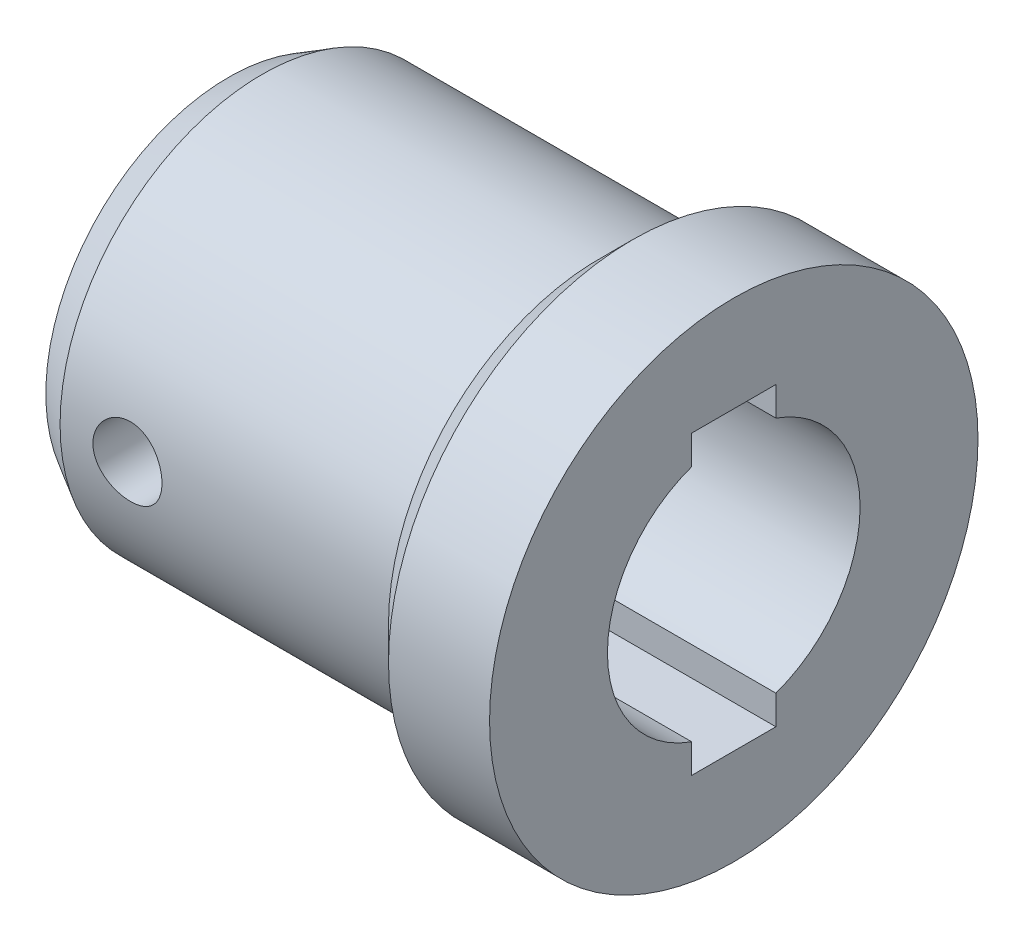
ISO-10303-21;
HEADER;
FILE_DESCRIPTION(('STEP AP214'),'2;1');
FILE_NAME('part.step','',(''),(''),'','','');
FILE_SCHEMA(('AUTOMOTIVE_DESIGN { 1 0 10303 214 1 1 1 1 }'));
ENDSEC;
DATA;
#1=APPLICATION_CONTEXT('core data for automotive mechanical design processes');
#2=APPLICATION_PROTOCOL_DEFINITION('international standard','automotive_design',2000,#1);
#3=PRODUCT_CONTEXT('',#1,'mechanical');
#4=PRODUCT('Part','Part','',(#3));
#5=PRODUCT_RELATED_PRODUCT_CATEGORY('part','',(#4));
#6=PRODUCT_DEFINITION_FORMATION('','',#4);
#7=PRODUCT_DEFINITION_CONTEXT('part definition',#1,'design');
#8=PRODUCT_DEFINITION('design','',#6,#7);
#9=PRODUCT_DEFINITION_SHAPE('','',#8);
#10=(LENGTH_UNIT() NAMED_UNIT(*) SI_UNIT(.MILLI.,.METRE.));
#11=(NAMED_UNIT(*) PLANE_ANGLE_UNIT() SI_UNIT($,.RADIAN.));
#12=(NAMED_UNIT(*) SI_UNIT($,.STERADIAN.) SOLID_ANGLE_UNIT());
#13=UNCERTAINTY_MEASURE_WITH_UNIT(LENGTH_MEASURE(1.E-05),#10,'distance_accuracy_value','');
#14=(GEOMETRIC_REPRESENTATION_CONTEXT(3) GLOBAL_UNCERTAINTY_ASSIGNED_CONTEXT((#13)) GLOBAL_UNIT_ASSIGNED_CONTEXT((#10,
#11,#12)) REPRESENTATION_CONTEXT('',''));
#15=CARTESIAN_POINT('',(0.,0.,0.));
#16=DIRECTION('',(0.,0.,1.));
#17=DIRECTION('',(1.,0.,0.));
#18=AXIS2_PLACEMENT_3D('',#15,#16,#17);
#19=CARTESIAN_POINT('',(0.,0.,0.));
#20=DIRECTION('',(-1.,0.,0.));
#21=DIRECTION('',(0.,0.,1.));
#22=AXIS2_PLACEMENT_3D('',#19,#20,#21);
#23=CYLINDRICAL_SURFACE('',#22,7.5);
#24=CARTESIAN_POINT('',(30.,0.,0.));
#25=DIRECTION('',(1.,0.,0.));
#26=DIRECTION('',(0.,0.,-1.));
#27=AXIS2_PLACEMENT_3D('',#24,#25,#26);
#28=CIRCLE('',#27,7.5);
#29=CARTESIAN_POINT('',(30.,-7.07106781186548,2.5));
#30=VERTEX_POINT('',#29);
#31=CARTESIAN_POINT('',(30.,7.07106781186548,2.5));
#32=VERTEX_POINT('',#31);
#33=EDGE_CURVE('E129',#30,#32,#28,.F.);
#34=ORIENTED_EDGE('',*,*,#33,.F.);
#35=DIRECTION('',(1.,0.,0.));
#36=VECTOR('',#35,1.);
#37=CARTESIAN_POINT('',(0.,-7.07106781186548,2.5));
#38=LINE('',#37,#36);
#39=CARTESIAN_POINT('',(0.,-7.07106781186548,2.5));
#40=VERTEX_POINT('',#39);
#41=EDGE_CURVE('E112',#40,#30,#38,.T.);
#42=ORIENTED_EDGE('',*,*,#41,.F.);
#43=CARTESIAN_POINT('',(0.,0.,0.));
#44=DIRECTION('',(-1.,0.,0.));
#45=DIRECTION('',(0.,0.,1.));
#46=AXIS2_PLACEMENT_3D('',#43,#44,#45);
#47=CIRCLE('',#46,7.5);
#48=CARTESIAN_POINT('',(0.,7.07106781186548,2.5));
#49=VERTEX_POINT('',#48);
#50=EDGE_CURVE('E160',#40,#49,#47,.T.);
#51=ORIENTED_EDGE('',*,*,#50,.T.);
#52=DIRECTION('',(1.,0.,0.));
#53=VECTOR('',#52,1.);
#54=CARTESIAN_POINT('',(0.,7.07106781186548,2.5));
#55=LINE('',#54,#53);
#56=EDGE_CURVE('E139',#49,#32,#55,.T.);
#57=ORIENTED_EDGE('',*,*,#56,.T.);
#58=EDGE_LOOP('',(#34,#42,#51,#57));
#59=FACE_BOUND('',#58,.T.);
#60=CARTESIAN_POINT('',(8.05,0.,7.5));
#61=CARTESIAN_POINT('',(8.04999754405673,-0.112905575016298,7.49999840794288));
#62=CARTESIAN_POINT('',(8.04064122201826,-0.225837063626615,7.497425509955));
#63=CARTESIAN_POINT('',(8.00353366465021,-0.448439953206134,7.48741184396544));
#64=CARTESIAN_POINT('',(7.97577422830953,-0.558109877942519,7.47996890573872));
#65=CARTESIAN_POINT('',(7.90283553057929,-0.770944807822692,7.46103553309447));
#66=CARTESIAN_POINT('',(7.85767936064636,-0.874118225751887,7.44955046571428));
#67=CARTESIAN_POINT('',(7.75131638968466,-1.07142788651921,7.42374272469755));
#68=CARTESIAN_POINT('',(7.69010830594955,-1.16556340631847,7.40941982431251));
#69=CARTESIAN_POINT('',(7.55181201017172,-1.34440842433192,7.37909077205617));
#70=CARTESIAN_POINT('',(7.47440650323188,-1.42886749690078,7.36305471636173));
#71=CARTESIAN_POINT('',(7.30659048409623,-1.58378179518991,7.33129604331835));
#72=CARTESIAN_POINT('',(7.21617820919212,-1.65423511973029,7.31557346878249));
#73=CARTESIAN_POINT('',(7.02289338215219,-1.78037731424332,7.28591410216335));
#74=CARTESIAN_POINT('',(6.91982432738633,-1.83577475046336,7.27201493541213));
#75=CARTESIAN_POINT('',(6.70539349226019,-1.92835423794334,7.24801719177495));
#76=CARTESIAN_POINT('',(6.59403333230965,-1.96553983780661,7.23791787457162));
#77=CARTESIAN_POINT('',(6.36896263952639,-2.01976397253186,7.22297261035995));
#78=CARTESIAN_POINT('',(6.25536992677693,-2.03725806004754,7.21800810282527));
#79=CARTESIAN_POINT('',(6.02676179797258,-2.05302331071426,7.21354061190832));
#80=CARTESIAN_POINT('',(5.91174666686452,-2.05129826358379,7.21403655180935));
#81=CARTESIAN_POINT('',(5.68714187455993,-2.02903513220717,7.22032800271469));
#82=CARTESIAN_POINT('',(5.57749213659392,-2.00905189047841,7.22596720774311));
#83=CARTESIAN_POINT('',(5.36316432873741,-1.95172975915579,7.24165902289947));
#84=CARTESIAN_POINT('',(5.25848667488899,-1.91438942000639,7.25171200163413));
#85=CARTESIAN_POINT('',(5.05564536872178,-1.82296940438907,7.27523361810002));
#86=CARTESIAN_POINT('',(4.95757279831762,-1.76869803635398,7.2887410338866));
#87=CARTESIAN_POINT('',(4.77173341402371,-1.64509014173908,7.31762916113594));
#88=CARTESIAN_POINT('',(4.68396872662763,-1.57575051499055,7.33301025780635));
#89=CARTESIAN_POINT('',(4.51807058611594,-1.4211529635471,7.36456014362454));
#90=CARTESIAN_POINT('',(4.44037144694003,-1.33543011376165,7.38073784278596));
#91=CARTESIAN_POINT('',(4.30036033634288,-1.15197228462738,7.41158548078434));
#92=CARTESIAN_POINT('',(4.23804903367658,-1.05423678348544,7.42625535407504));
#93=CARTESIAN_POINT('',(4.13037764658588,-0.848833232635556,7.45253238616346));
#94=CARTESIAN_POINT('',(4.08509953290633,-0.741120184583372,7.46412465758));
#95=CARTESIAN_POINT('',(4.0134212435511,-0.519220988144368,7.48283289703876));
#96=CARTESIAN_POINT('',(3.98701672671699,-0.405036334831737,7.4899498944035));
#97=CARTESIAN_POINT('',(3.95452490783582,-0.177138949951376,7.4987486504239));
#98=CARTESIAN_POINT('',(3.94784749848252,-0.0635163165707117,7.5005882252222));
#99=CARTESIAN_POINT('',(3.95336513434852,0.163226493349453,7.4990803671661));
#100=CARTESIAN_POINT('',(3.96555812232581,0.276346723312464,7.49573349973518));
#101=CARTESIAN_POINT('',(4.00798756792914,0.496744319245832,7.48433104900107));
#102=CARTESIAN_POINT('',(4.03789188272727,0.604090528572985,7.47636219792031));
#103=CARTESIAN_POINT('',(4.11450675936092,0.812229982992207,7.45662264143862));
#104=CARTESIAN_POINT('',(4.16121918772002,0.913022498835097,7.44485151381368));
#105=CARTESIAN_POINT('',(4.27119867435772,1.10746327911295,7.41844695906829));
#106=CARTESIAN_POINT('',(4.33478279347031,1.20092478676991,7.40376023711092));
#107=CARTESIAN_POINT('',(4.47630480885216,1.37605750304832,7.37322058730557));
#108=CARTESIAN_POINT('',(4.55424568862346,1.45772625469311,7.35736741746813));
#109=CARTESIAN_POINT('',(4.72502734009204,1.60946395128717,7.32569595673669));
#110=CARTESIAN_POINT('',(4.8182422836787,1.67911570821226,7.30989272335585));
#111=CARTESIAN_POINT('',(5.0153741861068,1.80180118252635,7.28062534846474));
#112=CARTESIAN_POINT('',(5.11929071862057,1.85483556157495,7.2671611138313));
#113=CARTESIAN_POINT('',(5.33438277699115,1.94238379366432,7.24425250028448));
#114=CARTESIAN_POINT('',(5.44551308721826,1.97700247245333,7.23478543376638));
#115=CARTESIAN_POINT('',(5.67232271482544,2.02696884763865,7.2209474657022));
#116=CARTESIAN_POINT('',(5.78800078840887,2.04232177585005,7.21657518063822));
#117=CARTESIAN_POINT('',(6.01633968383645,2.05300887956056,7.21354148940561));
#118=CARTESIAN_POINT('',(6.12896695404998,2.04901527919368,7.21468830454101));
#119=CARTESIAN_POINT('',(6.35187658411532,2.02269068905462,7.22211226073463));
#120=CARTESIAN_POINT('',(6.46215901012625,2.00036021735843,7.2283892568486));
#121=CARTESIAN_POINT('',(6.67635425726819,1.93839445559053,7.24524925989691));
#122=CARTESIAN_POINT('',(6.78031338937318,1.89890841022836,7.25579507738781));
#123=CARTESIAN_POINT('',(6.98021136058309,1.80386792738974,7.28000374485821));
#124=CARTESIAN_POINT('',(7.07614888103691,1.74831085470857,7.2936671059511));
#125=CARTESIAN_POINT('',(7.26047220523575,1.62069692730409,7.32309689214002));
#126=CARTESIAN_POINT('',(7.34853444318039,1.54818461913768,7.33891512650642));
#127=CARTESIAN_POINT('',(7.51145916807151,1.38957584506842,7.37059076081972));
#128=CARTESIAN_POINT('',(7.5863184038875,1.30347604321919,7.38644816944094));
#129=CARTESIAN_POINT('',(7.72239630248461,1.11776612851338,7.41684843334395));
#130=CARTESIAN_POINT('',(7.78326470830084,1.01789254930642,7.43135303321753));
#131=CARTESIAN_POINT('',(7.88725280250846,0.808935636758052,7.45698800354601));
#132=CARTESIAN_POINT('',(7.93038330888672,0.699857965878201,7.46812042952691));
#133=CARTESIAN_POINT('',(7.99237561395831,0.492734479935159,7.48440479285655));
#134=CARTESIAN_POINT('',(8.01393304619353,0.39553846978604,7.49020932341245));
#135=CARTESIAN_POINT('',(8.04274553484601,0.198901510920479,7.49800741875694));
#136=CARTESIAN_POINT('',(8.05000216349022,0.0994608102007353,7.50000140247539));
#137=CARTESIAN_POINT('',(8.05,0.,7.5));
#138=B_SPLINE_CURVE_WITH_KNOTS('',3,(#60,#61,#62,#63,#64,#65,#66,#67,#68,#69,#70,#71,#72,#73,
#74,#75,#76,#77,#78,#79,#80,#81,#82,#83,#84,#85,#86,#87,#88,#89,#90,#91,#92,#93,#94,#95,#96,#97,
#98,#99,#100,#101,#102,#103,#104,#105,#106,#107,#108,#109,#110,#111,#112,#113,#114,#115,#116,
#117,#118,#119,#120,#121,#122,#123,#124,#125,#126,#127,#128,#129,#130,#131,#132,#133,#134,#135,
#136,#137),.UNSPECIFIED.,.T.,.F.,(4,2,2,2,2,2,2,2,2,2,2,2,2,2,2,2,2,2,2,2,2,2,2,2,2,2,2,2,2,2,2,
2,2,2,2,2,2,2,4),(0.,0.338351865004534,0.676854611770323,1.01490958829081,1.352991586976,
1.69844880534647,2.04395288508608,2.39573284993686,2.74744424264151,3.09084008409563,
3.43416821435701,3.76739799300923,4.10065560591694,4.43783235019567,4.77507853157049,
5.12390751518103,5.47275165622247,5.82325373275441,6.17367516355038,6.51350246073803,
6.85329271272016,7.18690405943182,7.52055246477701,7.86097965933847,8.20147767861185,
8.55210162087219,8.90271160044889,9.25130388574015,9.59980148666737,9.93627865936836,
10.2727463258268,10.606343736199,10.9399958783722,11.2839235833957,11.6279358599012,
11.9797984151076,12.3314460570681,12.629539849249,12.9276008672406),.UNSPECIFIED.);
#139=CARTESIAN_POINT('',(8.05,0.,7.5));
#140=VERTEX_POINT('',#139);
#141=EDGE_CURVE('E134',#140,#140,#138,.T.);
#142=ORIENTED_EDGE('',*,*,#141,.F.);
#143=EDGE_LOOP('',(#142));
#144=FACE_BOUND('',#143,.T.);
#145=ADVANCED_FACE('F40',(#59,#144),#23,.F.);
#146=CARTESIAN_POINT('',(0.,0.,0.));
#147=DIRECTION('',(-1.,0.,0.));
#148=DIRECTION('',(0.,0.,1.));
#149=AXIS2_PLACEMENT_3D('',#146,#147,#148);
#150=CYLINDRICAL_SURFACE('',#149,12.);
#151=CARTESIAN_POINT('',(22.,0.,0.));
#152=DIRECTION('',(-1.,0.,0.));
#153=DIRECTION('',(0.,0.,1.));
#154=AXIS2_PLACEMENT_3D('',#151,#152,#153);
#155=CIRCLE('',#154,12.);
#156=CARTESIAN_POINT('',(22.,0.,12.));
#157=VERTEX_POINT('',#156);
#158=EDGE_CURVE('E142',#157,#157,#155,.T.);
#159=ORIENTED_EDGE('',*,*,#158,.T.);
#160=EDGE_LOOP('',(#159));
#161=FACE_BOUND('',#160,.T.);
#162=CARTESIAN_POINT('',(2.00000000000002,0.,0.));
#163=DIRECTION('',(1.,0.,0.));
#164=DIRECTION('',(0.,0.,-1.));
#165=AXIS2_PLACEMENT_3D('',#162,#163,#164);
#166=CIRCLE('',#165,12.);
#167=CARTESIAN_POINT('',(2.00000000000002,0.,-12.));
#168=VERTEX_POINT('',#167);
#169=EDGE_CURVE('E148',#168,#168,#166,.T.);
#170=ORIENTED_EDGE('',*,*,#169,.T.);
#171=EDGE_LOOP('',(#170));
#172=FACE_BOUND('',#171,.T.);
#173=CARTESIAN_POINT('',(8.05,0.,12.));
#174=CARTESIAN_POINT('',(8.04999545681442,0.114258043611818,11.9999980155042));
#175=CARTESIAN_POINT('',(8.04041536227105,0.228577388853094,11.9983511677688));
#176=CARTESIAN_POINT('',(8.00236570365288,0.454006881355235,11.9919401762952));
#177=CARTESIAN_POINT('',(7.97387904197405,0.565114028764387,11.9871732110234));
#178=CARTESIAN_POINT('',(7.89890386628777,0.780825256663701,11.9750563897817));
#179=CARTESIAN_POINT('',(7.85243037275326,0.88543467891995,11.9677086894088));
#180=CARTESIAN_POINT('',(7.74284072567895,1.08535849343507,11.9512372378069));
#181=CARTESIAN_POINT('',(7.6797263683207,1.18067388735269,11.9421136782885));
#182=CARTESIAN_POINT('',(7.53797392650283,1.36027196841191,11.9229988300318));
#183=CARTESIAN_POINT('',(7.4592016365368,1.44444799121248,11.9130004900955));
#184=CARTESIAN_POINT('',(7.28865822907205,1.59845623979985,11.8933166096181));
#185=CARTESIAN_POINT('',(7.1968862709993,1.66828753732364,11.8836310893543));
#186=CARTESIAN_POINT('',(7.00221181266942,1.7920546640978,11.8656011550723));
#187=CARTESIAN_POINT('',(6.89924096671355,1.84588443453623,11.8572658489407));
#188=CARTESIAN_POINT('',(6.68555224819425,1.93544211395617,11.8429782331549));
#189=CARTESIAN_POINT('',(6.57483492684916,1.97117130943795,11.8370257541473));
#190=CARTESIAN_POINT('',(6.34992889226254,2.02317633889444,11.8282481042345));
#191=CARTESIAN_POINT('',(6.23578402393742,2.03963669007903,11.8253932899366));
#192=CARTESIAN_POINT('',(6.00631956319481,2.053209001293,11.8230445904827));
#193=CARTESIAN_POINT('',(5.89100005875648,2.05032239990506,11.8235504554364));
#194=CARTESIAN_POINT('',(5.66378072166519,2.02543291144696,11.8278389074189));
#195=CARTESIAN_POINT('',(5.5518573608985,2.00363778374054,11.8315858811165));
#196=CARTESIAN_POINT('',(5.33327965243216,1.94187619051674,11.8418785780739));
#197=CARTESIAN_POINT('',(5.22662549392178,1.90190907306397,11.8484244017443));
#198=CARTESIAN_POINT('',(5.0209944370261,1.80472881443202,11.8636154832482));
#199=CARTESIAN_POINT('',(4.92205889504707,1.74742985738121,11.8722711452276));
#200=CARTESIAN_POINT('',(4.73512813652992,1.61727330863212,11.8906994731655));
#201=CARTESIAN_POINT('',(4.64713384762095,1.54441439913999,11.9004722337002));
#202=CARTESIAN_POINT('',(4.4833812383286,1.38407642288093,11.9201898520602));
#203=CARTESIAN_POINT('',(4.40779731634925,1.29641920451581,11.9301352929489));
#204=CARTESIAN_POINT('',(4.27238403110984,1.10957416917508,11.9489600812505));
#205=CARTESIAN_POINT('',(4.21255477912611,1.01038627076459,11.9578394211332));
#206=CARTESIAN_POINT('',(4.1103314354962,0.803128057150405,11.9735451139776));
#207=CARTESIAN_POINT('',(4.06795327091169,0.695049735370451,11.9803695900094));
#208=CARTESIAN_POINT('',(4.00199966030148,0.473166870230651,11.9911816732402));
#209=CARTESIAN_POINT('',(3.97842256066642,0.359362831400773,11.995169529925));
#210=CARTESIAN_POINT('',(3.9509779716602,0.130761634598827,11.9998253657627));
#211=CARTESIAN_POINT('',(3.94687115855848,0.0159940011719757,12.0005336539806));
#212=CARTESIAN_POINT('',(3.95784492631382,-0.212589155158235,11.9986611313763));
#213=CARTESIAN_POINT('',(3.97292473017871,-0.326404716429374,11.996080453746));
#214=CARTESIAN_POINT('',(4.02164462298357,-0.549109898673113,11.9879449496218));
#215=CARTESIAN_POINT('',(4.05516572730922,-0.658026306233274,11.9824091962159));
#216=CARTESIAN_POINT('',(4.13968947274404,-0.868693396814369,11.9689817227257));
#217=CARTESIAN_POINT('',(4.19069313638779,-0.970443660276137,11.961089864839));
#218=CARTESIAN_POINT('',(4.30927878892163,-1.16492623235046,11.9437254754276));
#219=CARTESIAN_POINT('',(4.3770096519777,-1.25756649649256,11.934239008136));
#220=CARTESIAN_POINT('',(4.52692292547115,-1.4302516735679,11.9147784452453));
#221=CARTESIAN_POINT('',(4.60910644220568,-1.51029562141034,11.9048043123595));
#222=CARTESIAN_POINT('',(4.78666749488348,-1.65640741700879,11.8853615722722));
#223=CARTESIAN_POINT('',(4.88217920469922,-1.72231324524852,11.875899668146));
#224=CARTESIAN_POINT('',(5.08305863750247,-1.83714499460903,11.8586796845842));
#225=CARTESIAN_POINT('',(5.18842603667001,-1.88607147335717,11.8509215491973));
#226=CARTESIAN_POINT('',(5.4055808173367,-1.96531574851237,11.8380382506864));
#227=CARTESIAN_POINT('',(5.51733852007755,-1.99571296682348,11.8329018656));
#228=CARTESIAN_POINT('',(5.74446900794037,-2.03728491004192,11.825815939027));
#229=CARTESIAN_POINT('',(5.85984146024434,-2.04846139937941,11.8238661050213));
#230=CARTESIAN_POINT('',(6.0893076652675,-2.05122352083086,11.823387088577));
#231=CARTESIAN_POINT('',(6.20339833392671,-2.04306427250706,11.8248133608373));
#232=CARTESIAN_POINT('',(6.42855771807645,-2.00793949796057,11.8308280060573));
#233=CARTESIAN_POINT('',(6.53962644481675,-1.98097404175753,11.8354163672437));
#234=CARTESIAN_POINT('',(6.75548306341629,-1.90910197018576,11.8472209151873));
#235=CARTESIAN_POINT('',(6.86027882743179,-1.86421840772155,11.8544337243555));
#236=CARTESIAN_POINT('',(7.06089402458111,-1.75781070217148,11.8706775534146));
#237=CARTESIAN_POINT('',(7.15671297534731,-1.69628566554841,11.8797086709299));
#238=CARTESIAN_POINT('',(7.33794148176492,-1.55743545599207,11.8987122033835));
#239=CARTESIAN_POINT('',(7.42320646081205,-1.47992296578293,11.908694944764));
#240=CARTESIAN_POINT('',(7.57960614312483,-1.3116924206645,11.9283955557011));
#241=CARTESIAN_POINT('',(7.65073758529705,-1.22097132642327,11.9381133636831));
#242=CARTESIAN_POINT('',(7.77732743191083,-1.02811092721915,11.9562715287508));
#243=CARTESIAN_POINT('',(7.83266774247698,-0.925893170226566,11.9647020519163));
#244=CARTESIAN_POINT('',(7.92530566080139,-0.713507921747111,11.9792400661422));
#245=CARTESIAN_POINT('',(7.9626210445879,-0.603348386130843,11.9853498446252));
#246=CARTESIAN_POINT('',(8.01014947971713,-0.410649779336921,11.9932412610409));
#247=CARTESIAN_POINT('',(8.02506919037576,-0.329269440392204,11.9957620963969));
#248=CARTESIAN_POINT('',(8.04499600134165,-0.16527007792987,11.9991421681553));
#249=CARTESIAN_POINT('',(8.05000328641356,-0.0826510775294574,12.0000014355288));
#250=CARTESIAN_POINT('',(8.05,0.,12.));
#251=B_SPLINE_CURVE_WITH_KNOTS('',3,(#173,#174,#175,#176,#177,#178,#179,#180,#181,#182,#183,
#184,#185,#186,#187,#188,#189,#190,#191,#192,#193,#194,#195,#196,#197,#198,#199,#200,#201,#202,
#203,#204,#205,#206,#207,#208,#209,#210,#211,#212,#213,#214,#215,#216,#217,#218,#219,#220,#221,
#222,#223,#224,#225,#226,#227,#228,#229,#230,#231,#232,#233,#234,#235,#236,#237,#238,#239,#240,
#241,#242,#243,#244,#245,#246,#247,#248,#249,#250),.UNSPECIFIED.,.T.,.F.,(4,2,2,2,2,2,2,2,2,2,2,
2,2,2,2,2,2,2,2,2,2,2,2,2,2,2,2,2,2,2,2,2,2,2,2,2,2,2,4),(0.,0.342471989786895,
0.685254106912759,1.02775058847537,1.37021011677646,1.71574236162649,2.06129695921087,
2.40909329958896,2.75686491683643,3.1012783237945,3.44566612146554,3.78631717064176,
4.12698044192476,4.46935885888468,4.81176628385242,5.15863584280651,5.50550785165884,
5.85269574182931,6.19985309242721,6.54273201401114,6.88559705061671,7.22627540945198,
7.56697369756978,7.91082101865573,8.25469467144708,8.60232026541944,8.9499344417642,
9.29604796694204,9.64212971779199,9.98367067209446,10.3252103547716,10.6663120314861,
11.007432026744,11.352802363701,11.69825229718,12.046221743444,12.3938473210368,
12.6415866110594,12.889321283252),.UNSPECIFIED.);
#252=CARTESIAN_POINT('',(8.05,0.,12.));
#253=VERTEX_POINT('',#252);
#254=EDGE_CURVE('E44',#253,#253,#251,.T.);
#255=ORIENTED_EDGE('',*,*,#254,.F.);
#256=EDGE_LOOP('',(#255));
#257=FACE_BOUND('',#256,.T.);
#258=ADVANCED_FACE('F240',(#161,#172,#257),#150,.T.);
#259=CARTESIAN_POINT('',(0.,7.07106781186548,-2.5));
#260=VERTEX_POINT('',#259);
#261=CARTESIAN_POINT('',(0.,-7.07106781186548,-2.5));
#262=VERTEX_POINT('',#261);
#263=EDGE_CURVE('E157',#260,#262,#47,.T.);
#264=ORIENTED_EDGE('',*,*,#263,.T.);
#265=DIRECTION('',(1.,0.,0.));
#266=VECTOR('',#265,1.);
#267=CARTESIAN_POINT('',(0.,-7.07106781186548,-2.5));
#268=LINE('',#267,#266);
#269=CARTESIAN_POINT('',(30.,-7.07106781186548,-2.5));
#270=VERTEX_POINT('',#269);
#271=EDGE_CURVE('E181',#262,#270,#268,.T.);
#272=ORIENTED_EDGE('',*,*,#271,.T.);
#273=CARTESIAN_POINT('',(30.,7.07106781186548,-2.5));
#274=VERTEX_POINT('',#273);
#275=EDGE_CURVE('E140',#274,#270,#28,.F.);
#276=ORIENTED_EDGE('',*,*,#275,.F.);
#277=DIRECTION('',(1.,0.,0.));
#278=VECTOR('',#277,1.);
#279=CARTESIAN_POINT('',(0.,7.07106781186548,-2.5));
#280=LINE('',#279,#278);
#281=EDGE_CURVE('E164',#260,#274,#280,.T.);
#282=ORIENTED_EDGE('',*,*,#281,.F.);
#283=EDGE_LOOP('',(#264,#272,#276,#282));
#284=FACE_BOUND('',#283,.T.);
#285=ADVANCED_FACE('F243',(#284),#23,.F.);
#286=CARTESIAN_POINT('',(0.,0.,0.));
#287=DIRECTION('',(-1.,0.,0.));
#288=DIRECTION('',(0.,0.,1.));
#289=AXIS2_PLACEMENT_3D('',#286,#287,#288);
#290=CYLINDRICAL_SURFACE('',#289,14.5);
#291=CARTESIAN_POINT('',(24.,0.,0.));
#292=DIRECTION('',(1.,0.,0.));
#293=DIRECTION('',(0.,0.,-1.));
#294=AXIS2_PLACEMENT_3D('',#291,#292,#293);
#295=CIRCLE('',#294,14.5);
#296=CARTESIAN_POINT('',(24.,0.,-14.5));
#297=VERTEX_POINT('',#296);
#298=EDGE_CURVE('E11',#297,#297,#295,.T.);
#299=ORIENTED_EDGE('',*,*,#298,.T.);
#300=EDGE_LOOP('',(#299));
#301=FACE_BOUND('',#300,.T.);
#302=CARTESIAN_POINT('',(30.,0.,0.));
#303=DIRECTION('',(-1.,0.,0.));
#304=DIRECTION('',(0.,0.,1.));
#305=AXIS2_PLACEMENT_3D('',#302,#303,#304);
#306=CIRCLE('',#305,14.5);
#307=CARTESIAN_POINT('',(30.,0.,14.5));
#308=VERTEX_POINT('',#307);
#309=EDGE_CURVE('E154',#308,#308,#306,.T.);
#310=ORIENTED_EDGE('',*,*,#309,.T.);
#311=EDGE_LOOP('',(#310));
#312=FACE_BOUND('',#311,.T.);
#313=ADVANCED_FACE('F42',(#301,#312),#290,.T.);
#314=CARTESIAN_POINT('',(30.,14.5,0.));
#315=DIRECTION('',(-1.,0.,0.));
#316=DIRECTION('',(0.,0.,1.));
#317=AXIS2_PLACEMENT_3D('',#314,#315,#316);
#318=PLANE('',#317);
#319=ORIENTED_EDGE('',*,*,#309,.F.);
#320=EDGE_LOOP('',(#319));
#321=FACE_BOUND('',#320,.T.);
#322=ORIENTED_EDGE('',*,*,#275,.T.);
#323=DIRECTION('',(0.,1.,0.));
#324=VECTOR('',#323,1.);
#325=CARTESIAN_POINT('',(30.,-7.07106781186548,-2.5));
#326=LINE('',#325,#324);
#327=CARTESIAN_POINT('',(30.,-8.8,-2.5));
#328=VERTEX_POINT('',#327);
#329=EDGE_CURVE('E192',#328,#270,#326,.T.);
#330=ORIENTED_EDGE('',*,*,#329,.F.);
#331=DIRECTION('',(0.,0.,-1.));
#332=VECTOR('',#331,1.);
#333=CARTESIAN_POINT('',(30.,-8.8,2.5));
#334=LINE('',#333,#332);
#335=CARTESIAN_POINT('',(30.,-8.8,2.5));
#336=VERTEX_POINT('',#335);
#337=EDGE_CURVE('E133',#336,#328,#334,.T.);
#338=ORIENTED_EDGE('',*,*,#337,.F.);
#339=DIRECTION('',(0.,-1.,0.));
#340=VECTOR('',#339,1.);
#341=CARTESIAN_POINT('',(30.,-7.07106781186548,2.5));
#342=LINE('',#341,#340);
#343=EDGE_CURVE('E115',#30,#336,#342,.T.);
#344=ORIENTED_EDGE('',*,*,#343,.F.);
#345=ORIENTED_EDGE('',*,*,#33,.T.);
#346=DIRECTION('',(0.,-1.,0.));
#347=VECTOR('',#346,1.);
#348=CARTESIAN_POINT('',(30.,7.07106781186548,2.5));
#349=LINE('',#348,#347);
#350=CARTESIAN_POINT('',(30.,8.8,2.5));
#351=VERTEX_POINT('',#350);
#352=EDGE_CURVE('E180',#351,#32,#349,.T.);
#353=ORIENTED_EDGE('',*,*,#352,.F.);
#354=DIRECTION('',(0.,0.,1.));
#355=VECTOR('',#354,1.);
#356=CARTESIAN_POINT('',(30.,8.8,2.5));
#357=LINE('',#356,#355);
#358=CARTESIAN_POINT('',(30.,8.8,-2.5));
#359=VERTEX_POINT('',#358);
#360=EDGE_CURVE('E174',#359,#351,#357,.T.);
#361=ORIENTED_EDGE('',*,*,#360,.F.);
#362=DIRECTION('',(0.,1.,0.));
#363=VECTOR('',#362,1.);
#364=CARTESIAN_POINT('',(30.,7.07106781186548,-2.5));
#365=LINE('',#364,#363);
#366=EDGE_CURVE('E177',#274,#359,#365,.T.);
#367=ORIENTED_EDGE('',*,*,#366,.F.);
#368=EDGE_LOOP('',(#322,#330,#338,#344,#345,#353,#361,#367));
#369=FACE_BOUND('',#368,.T.);
#370=ADVANCED_FACE('F127',(#321,#369),#318,.F.);
#371=CARTESIAN_POINT('',(0.,7.5,0.));
#372=DIRECTION('',(1.,0.,0.));
#373=DIRECTION('',(0.,0.,-1.));
#374=AXIS2_PLACEMENT_3D('',#371,#372,#373);
#375=PLANE('',#374);
#376=CARTESIAN_POINT('',(0.,0.,0.));
#377=DIRECTION('',(1.,0.,0.));
#378=DIRECTION('',(0.,0.,-1.));
#379=AXIS2_PLACEMENT_3D('',#376,#377,#378);
#380=CIRCLE('',#379,10.8452994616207);
#381=CARTESIAN_POINT('',(0.,0.,-10.8452994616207));
#382=VERTEX_POINT('',#381);
#383=EDGE_CURVE('E151',#382,#382,#380,.F.);
#384=ORIENTED_EDGE('',*,*,#383,.T.);
#385=EDGE_LOOP('',(#384));
#386=FACE_BOUND('',#385,.T.);
#387=DIRECTION('',(0.,0.,-1.));
#388=VECTOR('',#387,1.);
#389=CARTESIAN_POINT('',(0.,-8.8,2.5));
#390=LINE('',#389,#388);
#391=CARTESIAN_POINT('',(0.,-8.8,2.5));
#392=VERTEX_POINT('',#391);
#393=CARTESIAN_POINT('',(0.,-8.8,-2.5));
#394=VERTEX_POINT('',#393);
#395=EDGE_CURVE('E62',#392,#394,#390,.T.);
#396=ORIENTED_EDGE('',*,*,#395,.T.);
#397=DIRECTION('',(0.,1.,0.));
#398=VECTOR('',#397,1.);
#399=CARTESIAN_POINT('',(0.,-7.07106781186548,-2.5));
#400=LINE('',#399,#398);
#401=EDGE_CURVE('E123',#394,#262,#400,.T.);
#402=ORIENTED_EDGE('',*,*,#401,.T.);
#403=ORIENTED_EDGE('',*,*,#263,.F.);
#404=DIRECTION('',(0.,1.,0.));
#405=VECTOR('',#404,1.);
#406=CARTESIAN_POINT('',(0.,7.07106781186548,-2.5));
#407=LINE('',#406,#405);
#408=CARTESIAN_POINT('',(0.,8.8,-2.5));
#409=VERTEX_POINT('',#408);
#410=EDGE_CURVE('E168',#260,#409,#407,.T.);
#411=ORIENTED_EDGE('',*,*,#410,.T.);
#412=DIRECTION('',(0.,0.,1.));
#413=VECTOR('',#412,1.);
#414=CARTESIAN_POINT('',(0.,8.8,2.5));
#415=LINE('',#414,#413);
#416=CARTESIAN_POINT('',(0.,8.8,2.5));
#417=VERTEX_POINT('',#416);
#418=EDGE_CURVE('E70',#409,#417,#415,.T.);
#419=ORIENTED_EDGE('',*,*,#418,.T.);
#420=DIRECTION('',(0.,-1.,0.));
#421=VECTOR('',#420,1.);
#422=CARTESIAN_POINT('',(0.,7.07106781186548,2.5));
#423=LINE('',#422,#421);
#424=EDGE_CURVE('E171',#417,#49,#423,.T.);
#425=ORIENTED_EDGE('',*,*,#424,.T.);
#426=ORIENTED_EDGE('',*,*,#50,.F.);
#427=DIRECTION('',(0.,-1.,0.));
#428=VECTOR('',#427,1.);
#429=CARTESIAN_POINT('',(0.,-7.07106781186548,2.5));
#430=LINE('',#429,#428);
#431=EDGE_CURVE('E118',#40,#392,#430,.T.);
#432=ORIENTED_EDGE('',*,*,#431,.T.);
#433=EDGE_LOOP('',(#396,#402,#403,#411,#419,#425,#426,#432));
#434=FACE_BOUND('',#433,.T.);
#435=ADVANCED_FACE('F238',(#386,#434),#375,.F.);
#436=CARTESIAN_POINT('',(22.,12.,0.));
#437=DIRECTION('',(1.,0.,0.));
#438=DIRECTION('',(0.,0.,-1.));
#439=AXIS2_PLACEMENT_3D('',#436,#437,#438);
#440=PLANE('',#439);
#441=CARTESIAN_POINT('',(22.,0.,0.));
#442=DIRECTION('',(1.,0.,0.));
#443=DIRECTION('',(0.,0.,-1.));
#444=AXIS2_PLACEMENT_3D('',#441,#442,#443);
#445=CIRCLE('',#444,12.5);
#446=CARTESIAN_POINT('',(22.,0.,-12.5));
#447=VERTEX_POINT('',#446);
#448=EDGE_CURVE('E54',#447,#447,#445,.F.);
#449=ORIENTED_EDGE('',*,*,#448,.T.);
#450=EDGE_LOOP('',(#449));
#451=FACE_BOUND('',#450,.T.);
#452=ORIENTED_EDGE('',*,*,#158,.F.);
#453=EDGE_LOOP('',(#452));
#454=FACE_BOUND('',#453,.T.);
#455=ADVANCED_FACE('F235',(#451,#454),#440,.F.);
#456=CARTESIAN_POINT('',(0.,0.,0.));
#457=DIRECTION('',(1.,0.,0.));
#458=DIRECTION('',(0.,0.,-1.));
#459=AXIS2_PLACEMENT_3D('',#456,#457,#458);
#460=CONICAL_SURFACE('',#459,10.8452994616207,0.523598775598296);
#461=ORIENTED_EDGE('',*,*,#169,.F.);
#462=EDGE_LOOP('',(#461));
#463=FACE_BOUND('',#462,.T.);
#464=ORIENTED_EDGE('',*,*,#383,.F.);
#465=EDGE_LOOP('',(#464));
#466=FACE_BOUND('',#465,.T.);
#467=ADVANCED_FACE('F231',(#463,#466),#460,.T.);
#468=CARTESIAN_POINT('',(22.,0.,0.));
#469=DIRECTION('',(1.,0.,0.));
#470=DIRECTION('',(0.,0.,-1.));
#471=AXIS2_PLACEMENT_3D('',#468,#469,#470);
#472=CONICAL_SURFACE('',#471,12.5,0.785398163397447);
#473=ORIENTED_EDGE('',*,*,#298,.F.);
#474=EDGE_LOOP('',(#473));
#475=FACE_BOUND('',#474,.T.);
#476=ORIENTED_EDGE('',*,*,#448,.F.);
#477=EDGE_LOOP('',(#476));
#478=FACE_BOUND('',#477,.T.);
#479=ADVANCED_FACE('F227',(#475,#478),#472,.T.);
#480=CARTESIAN_POINT('',(0.,7.07106781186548,2.5));
#481=DIRECTION('',(0.,0.,1.));
#482=DIRECTION('',(0.,-1.,0.));
#483=AXIS2_PLACEMENT_3D('',#480,#481,#482);
#484=PLANE('',#483);
#485=ORIENTED_EDGE('',*,*,#352,.T.);
#486=ORIENTED_EDGE('',*,*,#56,.F.);
#487=ORIENTED_EDGE('',*,*,#424,.F.);
#488=DIRECTION('',(1.,0.,0.));
#489=VECTOR('',#488,1.);
#490=CARTESIAN_POINT('',(0.,8.8,2.5));
#491=LINE('',#490,#489);
#492=EDGE_CURVE('E141',#417,#351,#491,.T.);
#493=ORIENTED_EDGE('',*,*,#492,.T.);
#494=EDGE_LOOP('',(#485,#486,#487,#493));
#495=FACE_BOUND('',#494,.T.);
#496=ADVANCED_FACE('F221',(#495),#484,.F.);
#497=CARTESIAN_POINT('',(0.,8.8,2.5));
#498=DIRECTION('',(0.,1.,0.));
#499=DIRECTION('',(0.,0.,1.));
#500=AXIS2_PLACEMENT_3D('',#497,#498,#499);
#501=PLANE('',#500);
#502=ORIENTED_EDGE('',*,*,#360,.T.);
#503=ORIENTED_EDGE('',*,*,#492,.F.);
#504=ORIENTED_EDGE('',*,*,#418,.F.);
#505=DIRECTION('',(1.,0.,0.));
#506=VECTOR('',#505,1.);
#507=CARTESIAN_POINT('',(0.,8.8,-2.5));
#508=LINE('',#507,#506);
#509=EDGE_CURVE('E143',#409,#359,#508,.T.);
#510=ORIENTED_EDGE('',*,*,#509,.T.);
#511=EDGE_LOOP('',(#502,#503,#504,#510));
#512=FACE_BOUND('',#511,.T.);
#513=ADVANCED_FACE('F218',(#512),#501,.F.);
#514=CARTESIAN_POINT('',(0.,7.07106781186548,-2.5));
#515=DIRECTION('',(0.,0.,-1.));
#516=DIRECTION('',(0.,1.,0.));
#517=AXIS2_PLACEMENT_3D('',#514,#515,#516);
#518=PLANE('',#517);
#519=ORIENTED_EDGE('',*,*,#366,.T.);
#520=ORIENTED_EDGE('',*,*,#509,.F.);
#521=ORIENTED_EDGE('',*,*,#410,.F.);
#522=ORIENTED_EDGE('',*,*,#281,.T.);
#523=EDGE_LOOP('',(#519,#520,#521,#522));
#524=FACE_BOUND('',#523,.T.);
#525=ADVANCED_FACE('F212',(#524),#518,.F.);
#526=CARTESIAN_POINT('',(0.,-7.07106781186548,-2.5));
#527=DIRECTION('',(0.,0.,-1.));
#528=DIRECTION('',(0.,1.,0.));
#529=AXIS2_PLACEMENT_3D('',#526,#527,#528);
#530=PLANE('',#529);
#531=ORIENTED_EDGE('',*,*,#329,.T.);
#532=ORIENTED_EDGE('',*,*,#271,.F.);
#533=ORIENTED_EDGE('',*,*,#401,.F.);
#534=DIRECTION('',(1.,0.,0.));
#535=VECTOR('',#534,1.);
#536=CARTESIAN_POINT('',(0.,-8.8,-2.5));
#537=LINE('',#536,#535);
#538=EDGE_CURVE('E184',#394,#328,#537,.T.);
#539=ORIENTED_EDGE('',*,*,#538,.T.);
#540=EDGE_LOOP('',(#531,#532,#533,#539));
#541=FACE_BOUND('',#540,.T.);
#542=ADVANCED_FACE('F207',(#541),#530,.F.);
#543=CARTESIAN_POINT('',(0.,-8.8,2.5));
#544=DIRECTION('',(0.,-1.,0.));
#545=DIRECTION('',(0.,0.,-1.));
#546=AXIS2_PLACEMENT_3D('',#543,#544,#545);
#547=PLANE('',#546);
#548=ORIENTED_EDGE('',*,*,#337,.T.);
#549=ORIENTED_EDGE('',*,*,#538,.F.);
#550=ORIENTED_EDGE('',*,*,#395,.F.);
#551=DIRECTION('',(1.,0.,0.));
#552=VECTOR('',#551,1.);
#553=CARTESIAN_POINT('',(0.,-8.8,2.5));
#554=LINE('',#553,#552);
#555=EDGE_CURVE('E122',#392,#336,#554,.T.);
#556=ORIENTED_EDGE('',*,*,#555,.T.);
#557=EDGE_LOOP('',(#548,#549,#550,#556));
#558=FACE_BOUND('',#557,.T.);
#559=ADVANCED_FACE('F211',(#558),#547,.F.);
#560=CARTESIAN_POINT('',(0.,-7.07106781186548,2.5));
#561=DIRECTION('',(0.,0.,1.));
#562=DIRECTION('',(0.,-1.,0.));
#563=AXIS2_PLACEMENT_3D('',#560,#561,#562);
#564=PLANE('',#563);
#565=ORIENTED_EDGE('',*,*,#343,.T.);
#566=ORIENTED_EDGE('',*,*,#555,.F.);
#567=ORIENTED_EDGE('',*,*,#431,.F.);
#568=ORIENTED_EDGE('',*,*,#41,.T.);
#569=EDGE_LOOP('',(#565,#566,#567,#568));
#570=FACE_BOUND('',#569,.T.);
#571=ADVANCED_FACE('F114',(#570),#564,.F.);
#572=CARTESIAN_POINT('',(6.,0.,14.5));
#573=DIRECTION('',(0.,0.,-1.));
#574=DIRECTION('',(-1.,0.,0.));
#575=AXIS2_PLACEMENT_3D('',#572,#573,#574);
#576=CYLINDRICAL_SURFACE('',#575,2.05);
#577=ORIENTED_EDGE('',*,*,#254,.T.);
#578=EDGE_LOOP('',(#577));
#579=FACE_BOUND('',#578,.T.);
#580=ORIENTED_EDGE('',*,*,#141,.T.);
#581=EDGE_LOOP('',(#580));
#582=FACE_BOUND('',#581,.T.);
#583=ADVANCED_FACE('F202',(#579,#582),#576,.F.);
#584=CLOSED_SHELL('',(#145,#258,#285,#313,#370,#435,#455,#467,#479,#496,#513,#525,#542,#559,
#571,#583));
#585=MANIFOLD_SOLID_BREP('B2',#584);
#586=ADVANCED_BREP_SHAPE_REPRESENTATION('',(#18,#585),#14);
#587=SHAPE_DEFINITION_REPRESENTATION(#9,#586);
ENDSEC;
END-ISO-10303-21;
